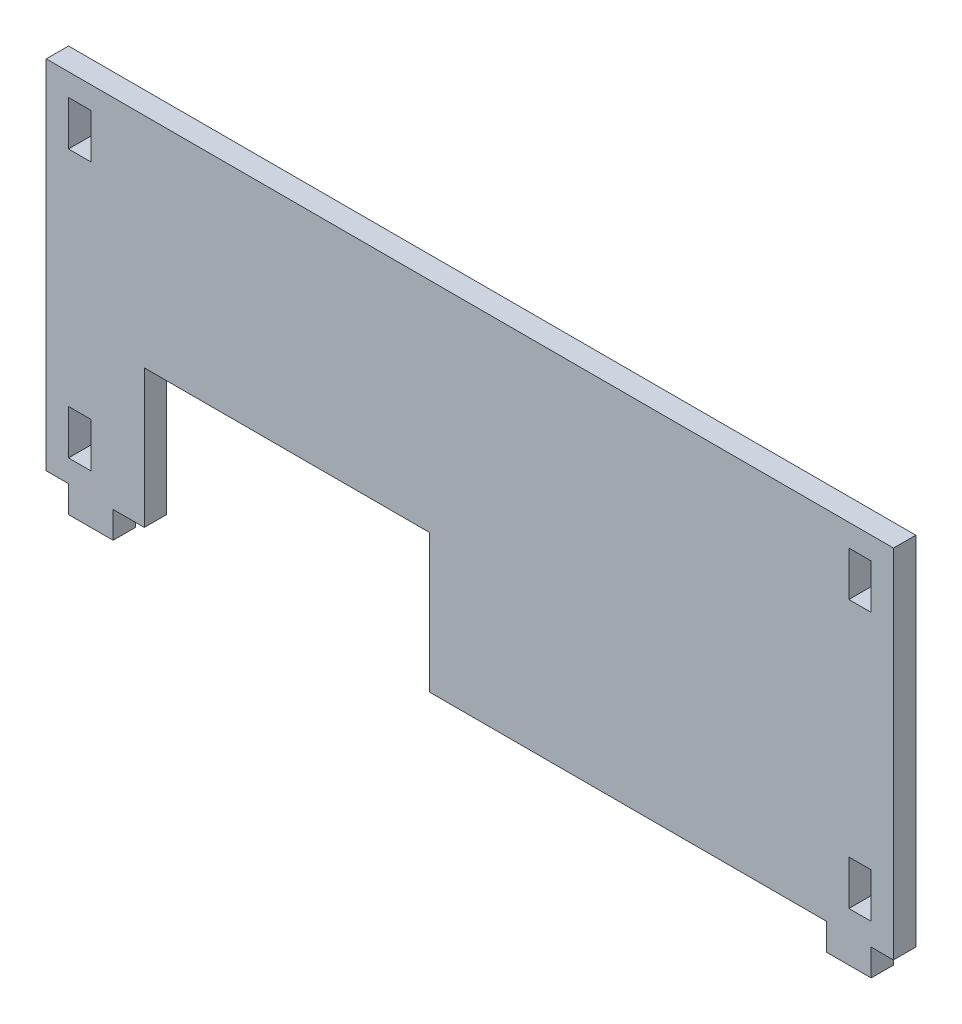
ISO-10303-21;
HEADER;
FILE_DESCRIPTION(('STEP AP214'),'2;1');
FILE_NAME('part.step','',(''),(''),'','','');
FILE_SCHEMA(('AUTOMOTIVE_DESIGN { 1 0 10303 214 1 1 1 1 }'));
ENDSEC;
DATA;
#1=APPLICATION_CONTEXT('core data for automotive mechanical design processes');
#2=APPLICATION_PROTOCOL_DEFINITION('international standard','automotive_design',2000,#1);
#3=PRODUCT_CONTEXT('',#1,'mechanical');
#4=PRODUCT('Part','Part','',(#3));
#5=PRODUCT_RELATED_PRODUCT_CATEGORY('part','',(#4));
#6=PRODUCT_DEFINITION_FORMATION('','',#4);
#7=PRODUCT_DEFINITION_CONTEXT('part definition',#1,'design');
#8=PRODUCT_DEFINITION('design','',#6,#7);
#9=PRODUCT_DEFINITION_SHAPE('','',#8);
#10=(LENGTH_UNIT() NAMED_UNIT(*) SI_UNIT(.MILLI.,.METRE.));
#11=(NAMED_UNIT(*) PLANE_ANGLE_UNIT() SI_UNIT($,.RADIAN.));
#12=(NAMED_UNIT(*) SI_UNIT($,.STERADIAN.) SOLID_ANGLE_UNIT());
#13=UNCERTAINTY_MEASURE_WITH_UNIT(LENGTH_MEASURE(1.E-05),#10,'distance_accuracy_value','');
#14=(GEOMETRIC_REPRESENTATION_CONTEXT(3) GLOBAL_UNCERTAINTY_ASSIGNED_CONTEXT((#13)) GLOBAL_UNIT_ASSIGNED_CONTEXT((#10,
#11,#12)) REPRESENTATION_CONTEXT('',''));
#15=CARTESIAN_POINT('',(0.,0.,0.));
#16=DIRECTION('',(0.,0.,1.));
#17=DIRECTION('',(1.,0.,0.));
#18=AXIS2_PLACEMENT_3D('',#15,#16,#17);
#19=CARTESIAN_POINT('',(0.,0.,3.175));
#20=DIRECTION('',(0.,0.,-1.));
#21=DIRECTION('',(-1.,0.,0.));
#22=AXIS2_PLACEMENT_3D('',#19,#20,#21);
#23=PLANE('',#22);
#24=DIRECTION('',(0.,1.,0.));
#25=VECTOR('',#24,1.);
#26=CARTESIAN_POINT('',(117.475,3.175,3.175));
#27=LINE('',#26,#25);
#28=CARTESIAN_POINT('',(117.475,3.175,3.175));
#29=VERTEX_POINT('',#28);
#30=CARTESIAN_POINT('',(117.475,9.525,3.175));
#31=VERTEX_POINT('',#30);
#32=EDGE_CURVE('E279',#29,#31,#27,.T.);
#33=ORIENTED_EDGE('',*,*,#32,.F.);
#34=DIRECTION('',(1.,0.,0.));
#35=VECTOR('',#34,1.);
#36=CARTESIAN_POINT('',(117.475,3.175,3.175));
#37=LINE('',#36,#35);
#38=CARTESIAN_POINT('',(114.3,3.175,3.175));
#39=VERTEX_POINT('',#38);
#40=EDGE_CURVE('E287',#39,#29,#37,.T.);
#41=ORIENTED_EDGE('',*,*,#40,.F.);
#42=DIRECTION('',(0.,-1.,0.));
#43=VECTOR('',#42,1.);
#44=CARTESIAN_POINT('',(114.3,3.175,3.175));
#45=LINE('',#44,#43);
#46=CARTESIAN_POINT('',(114.3,9.525,3.175));
#47=VERTEX_POINT('',#46);
#48=EDGE_CURVE('E284',#47,#39,#45,.T.);
#49=ORIENTED_EDGE('',*,*,#48,.F.);
#50=DIRECTION('',(-1.,0.,0.));
#51=VECTOR('',#50,1.);
#52=CARTESIAN_POINT('',(117.475,9.525,3.175));
#53=LINE('',#52,#51);
#54=EDGE_CURVE('E281',#31,#47,#53,.T.);
#55=ORIENTED_EDGE('',*,*,#54,.F.);
#56=EDGE_LOOP('',(#33,#41,#49,#55));
#57=FACE_BOUND('',#56,.T.);
#58=DIRECTION('',(0.,-1.,0.));
#59=VECTOR('',#58,1.);
#60=CARTESIAN_POINT('',(3.175,47.625,3.175));
#61=LINE('',#60,#59);
#62=CARTESIAN_POINT('',(3.175,47.625,3.175));
#63=VERTEX_POINT('',#62);
#64=CARTESIAN_POINT('',(3.175,41.275,3.175));
#65=VERTEX_POINT('',#64);
#66=EDGE_CURVE('E341',#63,#65,#61,.T.);
#67=ORIENTED_EDGE('',*,*,#66,.F.);
#68=DIRECTION('',(-1.,0.,0.));
#69=VECTOR('',#68,1.);
#70=CARTESIAN_POINT('',(3.175,47.625,3.175));
#71=LINE('',#70,#69);
#72=CARTESIAN_POINT('',(6.35,47.625,3.175));
#73=VERTEX_POINT('',#72);
#74=EDGE_CURVE('E349',#73,#63,#71,.T.);
#75=ORIENTED_EDGE('',*,*,#74,.F.);
#76=DIRECTION('',(0.,1.,0.));
#77=VECTOR('',#76,1.);
#78=CARTESIAN_POINT('',(6.35,47.625,3.175));
#79=LINE('',#78,#77);
#80=CARTESIAN_POINT('',(6.35,41.275,3.175));
#81=VERTEX_POINT('',#80);
#82=EDGE_CURVE('E346',#81,#73,#79,.T.);
#83=ORIENTED_EDGE('',*,*,#82,.F.);
#84=DIRECTION('',(1.,0.,0.));
#85=VECTOR('',#84,1.);
#86=CARTESIAN_POINT('',(3.175,41.275,3.175));
#87=LINE('',#86,#85);
#88=EDGE_CURVE('E343',#65,#81,#87,.T.);
#89=ORIENTED_EDGE('',*,*,#88,.F.);
#90=EDGE_LOOP('',(#67,#75,#83,#89));
#91=FACE_BOUND('',#90,.T.);
#92=DIRECTION('',(0.,-1.,0.));
#93=VECTOR('',#92,1.);
#94=CARTESIAN_POINT('',(0.,0.,3.175));
#95=LINE('',#94,#93);
#96=CARTESIAN_POINT('',(0.,50.8,3.175));
#97=VERTEX_POINT('',#96);
#98=CARTESIAN_POINT('',(0.,0.,3.175));
#99=VERTEX_POINT('',#98);
#100=EDGE_CURVE('E372',#97,#99,#95,.T.);
#101=ORIENTED_EDGE('',*,*,#100,.T.);
#102=DIRECTION('',(1.,0.,0.));
#103=VECTOR('',#102,1.);
#104=CARTESIAN_POINT('',(0.,0.,3.175));
#105=LINE('',#104,#103);
#106=CARTESIAN_POINT('',(3.175,0.,3.175));
#107=VERTEX_POINT('',#106);
#108=EDGE_CURVE('E375',#99,#107,#105,.T.);
#109=ORIENTED_EDGE('',*,*,#108,.T.);
#110=DIRECTION('',(0.,-1.,0.));
#111=VECTOR('',#110,1.);
#112=CARTESIAN_POINT('',(3.175,0.,3.175));
#113=LINE('',#112,#111);
#114=CARTESIAN_POINT('',(3.175,-3.81,3.175));
#115=VERTEX_POINT('',#114);
#116=EDGE_CURVE('E378',#107,#115,#113,.T.);
#117=ORIENTED_EDGE('',*,*,#116,.T.);
#118=DIRECTION('',(1.,0.,0.));
#119=VECTOR('',#118,1.);
#120=CARTESIAN_POINT('',(3.175,-3.81,3.175));
#121=LINE('',#120,#119);
#122=CARTESIAN_POINT('',(9.525,-3.81,3.175));
#123=VERTEX_POINT('',#122);
#124=EDGE_CURVE('E380',#115,#123,#121,.T.);
#125=ORIENTED_EDGE('',*,*,#124,.T.);
#126=DIRECTION('',(0.,1.,0.));
#127=VECTOR('',#126,1.);
#128=CARTESIAN_POINT('',(9.525,0.,3.175));
#129=LINE('',#128,#127);
#130=CARTESIAN_POINT('',(9.525,0.,3.175));
#131=VERTEX_POINT('',#130);
#132=EDGE_CURVE('E382',#123,#131,#129,.T.);
#133=ORIENTED_EDGE('',*,*,#132,.T.);
#134=DIRECTION('',(1.,0.,0.));
#135=VECTOR('',#134,1.);
#136=CARTESIAN_POINT('',(9.525,0.,3.175));
#137=LINE('',#136,#135);
#138=CARTESIAN_POINT('',(13.97,0.,3.175));
#139=VERTEX_POINT('',#138);
#140=EDGE_CURVE('E384',#131,#139,#137,.T.);
#141=ORIENTED_EDGE('',*,*,#140,.T.);
#142=DIRECTION('',(0.,1.,0.));
#143=VECTOR('',#142,1.);
#144=CARTESIAN_POINT('',(13.97,0.,3.175));
#145=LINE('',#144,#143);
#146=CARTESIAN_POINT('',(13.97,19.685,3.175));
#147=VERTEX_POINT('',#146);
#148=EDGE_CURVE('E386',#139,#147,#145,.T.);
#149=ORIENTED_EDGE('',*,*,#148,.T.);
#150=DIRECTION('',(1.,0.,0.));
#151=VECTOR('',#150,1.);
#152=CARTESIAN_POINT('',(13.97,19.685,3.175));
#153=LINE('',#152,#151);
#154=CARTESIAN_POINT('',(54.61,19.685,3.175));
#155=VERTEX_POINT('',#154);
#156=EDGE_CURVE('E388',#147,#155,#153,.T.);
#157=ORIENTED_EDGE('',*,*,#156,.T.);
#158=DIRECTION('',(0.,-1.,0.));
#159=VECTOR('',#158,1.);
#160=CARTESIAN_POINT('',(54.61,0.,3.175));
#161=LINE('',#160,#159);
#162=CARTESIAN_POINT('',(54.61,0.,3.175));
#163=VERTEX_POINT('',#162);
#164=EDGE_CURVE('E390',#155,#163,#161,.T.);
#165=ORIENTED_EDGE('',*,*,#164,.T.);
#166=DIRECTION('',(1.,0.,0.));
#167=VECTOR('',#166,1.);
#168=CARTESIAN_POINT('',(54.61,0.,3.175));
#169=LINE('',#168,#167);
#170=CARTESIAN_POINT('',(111.125,0.,3.175));
#171=VERTEX_POINT('',#170);
#172=EDGE_CURVE('E392',#163,#171,#169,.T.);
#173=ORIENTED_EDGE('',*,*,#172,.T.);
#174=DIRECTION('',(0.,-1.,0.));
#175=VECTOR('',#174,1.);
#176=CARTESIAN_POINT('',(111.125,0.,3.175));
#177=LINE('',#176,#175);
#178=CARTESIAN_POINT('',(111.125,-3.81,3.175));
#179=VERTEX_POINT('',#178);
#180=EDGE_CURVE('E394',#171,#179,#177,.T.);
#181=ORIENTED_EDGE('',*,*,#180,.T.);
#182=DIRECTION('',(1.,0.,0.));
#183=VECTOR('',#182,1.);
#184=CARTESIAN_POINT('',(117.475,-3.81,3.175));
#185=LINE('',#184,#183);
#186=CARTESIAN_POINT('',(117.475,-3.81,3.175));
#187=VERTEX_POINT('',#186);
#188=EDGE_CURVE('E396',#179,#187,#185,.T.);
#189=ORIENTED_EDGE('',*,*,#188,.T.);
#190=DIRECTION('',(0.,1.,0.));
#191=VECTOR('',#190,1.);
#192=CARTESIAN_POINT('',(117.475,0.,3.175));
#193=LINE('',#192,#191);
#194=CARTESIAN_POINT('',(117.475,0.,3.175));
#195=VERTEX_POINT('',#194);
#196=EDGE_CURVE('E398',#187,#195,#193,.T.);
#197=ORIENTED_EDGE('',*,*,#196,.T.);
#198=DIRECTION('',(1.,0.,0.));
#199=VECTOR('',#198,1.);
#200=CARTESIAN_POINT('',(117.475,0.,3.175));
#201=LINE('',#200,#199);
#202=CARTESIAN_POINT('',(120.65,0.,3.175));
#203=VERTEX_POINT('',#202);
#204=EDGE_CURVE('E400',#195,#203,#201,.T.);
#205=ORIENTED_EDGE('',*,*,#204,.T.);
#206=DIRECTION('',(0.,1.,0.));
#207=VECTOR('',#206,1.);
#208=CARTESIAN_POINT('',(120.65,0.,3.175));
#209=LINE('',#208,#207);
#210=CARTESIAN_POINT('',(120.65,50.8,3.175));
#211=VERTEX_POINT('',#210);
#212=EDGE_CURVE('E402',#203,#211,#209,.T.);
#213=ORIENTED_EDGE('',*,*,#212,.T.);
#214=DIRECTION('',(-1.,0.,0.));
#215=VECTOR('',#214,1.);
#216=CARTESIAN_POINT('',(0.,50.8,3.175));
#217=LINE('',#216,#215);
#218=EDGE_CURVE('E404',#211,#97,#217,.T.);
#219=ORIENTED_EDGE('',*,*,#218,.T.);
#220=EDGE_LOOP('',(#101,#109,#117,#125,#133,#141,#149,#157,#165,#173,#181,#189,#197,#205,#213,#219));
#221=FACE_BOUND('',#220,.T.);
#222=DIRECTION('',(0.,-1.,0.));
#223=VECTOR('',#222,1.);
#224=CARTESIAN_POINT('',(3.175,3.175,3.175));
#225=LINE('',#224,#223);
#226=CARTESIAN_POINT('',(3.175,9.525,3.175));
#227=VERTEX_POINT('',#226);
#228=CARTESIAN_POINT('',(3.175,3.175,3.175));
#229=VERTEX_POINT('',#228);
#230=EDGE_CURVE('E310',#227,#229,#225,.T.);
#231=ORIENTED_EDGE('',*,*,#230,.F.);
#232=DIRECTION('',(-1.,0.,0.));
#233=VECTOR('',#232,1.);
#234=CARTESIAN_POINT('',(3.175,9.525,3.175));
#235=LINE('',#234,#233);
#236=CARTESIAN_POINT('',(6.35,9.525,3.175));
#237=VERTEX_POINT('',#236);
#238=EDGE_CURVE('E318',#237,#227,#235,.T.);
#239=ORIENTED_EDGE('',*,*,#238,.F.);
#240=DIRECTION('',(0.,1.,0.));
#241=VECTOR('',#240,1.);
#242=CARTESIAN_POINT('',(6.35,3.175,3.175));
#243=LINE('',#242,#241);
#244=CARTESIAN_POINT('',(6.35,3.175,3.175));
#245=VERTEX_POINT('',#244);
#246=EDGE_CURVE('E315',#245,#237,#243,.T.);
#247=ORIENTED_EDGE('',*,*,#246,.F.);
#248=DIRECTION('',(1.,0.,0.));
#249=VECTOR('',#248,1.);
#250=CARTESIAN_POINT('',(3.175,3.175,3.175));
#251=LINE('',#250,#249);
#252=EDGE_CURVE('E312',#229,#245,#251,.T.);
#253=ORIENTED_EDGE('',*,*,#252,.F.);
#254=EDGE_LOOP('',(#231,#239,#247,#253));
#255=FACE_BOUND('',#254,.T.);
#256=DIRECTION('',(0.,1.,0.));
#257=VECTOR('',#256,1.);
#258=CARTESIAN_POINT('',(117.475,47.625,3.175));
#259=LINE('',#258,#257);
#260=CARTESIAN_POINT('',(117.475,41.275,3.175));
#261=VERTEX_POINT('',#260);
#262=CARTESIAN_POINT('',(117.475,47.625,3.175));
#263=VERTEX_POINT('',#262);
#264=EDGE_CURVE('E243',#261,#263,#259,.T.);
#265=ORIENTED_EDGE('',*,*,#264,.F.);
#266=DIRECTION('',(1.,0.,0.));
#267=VECTOR('',#266,1.);
#268=CARTESIAN_POINT('',(117.475,41.275,3.175));
#269=LINE('',#268,#267);
#270=CARTESIAN_POINT('',(114.3,41.275,3.175));
#271=VERTEX_POINT('',#270);
#272=EDGE_CURVE('E265',#271,#261,#269,.T.);
#273=ORIENTED_EDGE('',*,*,#272,.F.);
#274=DIRECTION('',(0.,-1.,0.));
#275=VECTOR('',#274,1.);
#276=CARTESIAN_POINT('',(114.3,47.625,3.175));
#277=LINE('',#276,#275);
#278=CARTESIAN_POINT('',(114.3,47.625,3.175));
#279=VERTEX_POINT('',#278);
#280=EDGE_CURVE('E263',#279,#271,#277,.T.);
#281=ORIENTED_EDGE('',*,*,#280,.F.);
#282=DIRECTION('',(-1.,0.,0.));
#283=VECTOR('',#282,1.);
#284=CARTESIAN_POINT('',(117.475,47.625,3.175));
#285=LINE('',#284,#283);
#286=EDGE_CURVE('E251',#263,#279,#285,.T.);
#287=ORIENTED_EDGE('',*,*,#286,.F.);
#288=EDGE_LOOP('',(#265,#273,#281,#287));
#289=FACE_BOUND('',#288,.T.);
#290=ADVANCED_FACE('F34',(#57,#91,#221,#255,#289),#23,.F.);
#291=CARTESIAN_POINT('',(0.,0.,0.));
#292=DIRECTION('',(0.,0.,-1.));
#293=DIRECTION('',(-1.,0.,0.));
#294=AXIS2_PLACEMENT_3D('',#291,#292,#293);
#295=PLANE('',#294);
#296=DIRECTION('',(1.,0.,0.));
#297=VECTOR('',#296,1.);
#298=CARTESIAN_POINT('',(117.475,3.175,0.));
#299=LINE('',#298,#297);
#300=CARTESIAN_POINT('',(114.3,3.175,0.));
#301=VERTEX_POINT('',#300);
#302=CARTESIAN_POINT('',(117.475,3.175,0.));
#303=VERTEX_POINT('',#302);
#304=EDGE_CURVE('E282',#301,#303,#299,.T.);
#305=ORIENTED_EDGE('',*,*,#304,.T.);
#306=DIRECTION('',(0.,1.,0.));
#307=VECTOR('',#306,1.);
#308=CARTESIAN_POINT('',(117.475,3.175,0.));
#309=LINE('',#308,#307);
#310=CARTESIAN_POINT('',(117.475,9.525,0.));
#311=VERTEX_POINT('',#310);
#312=EDGE_CURVE('E259',#303,#311,#309,.T.);
#313=ORIENTED_EDGE('',*,*,#312,.T.);
#314=DIRECTION('',(-1.,0.,0.));
#315=VECTOR('',#314,1.);
#316=CARTESIAN_POINT('',(117.475,9.525,0.));
#317=LINE('',#316,#315);
#318=CARTESIAN_POINT('',(114.3,9.525,0.));
#319=VERTEX_POINT('',#318);
#320=EDGE_CURVE('E292',#311,#319,#317,.T.);
#321=ORIENTED_EDGE('',*,*,#320,.T.);
#322=DIRECTION('',(0.,-1.,0.));
#323=VECTOR('',#322,1.);
#324=CARTESIAN_POINT('',(114.3,3.175,0.));
#325=LINE('',#324,#323);
#326=EDGE_CURVE('E295',#319,#301,#325,.T.);
#327=ORIENTED_EDGE('',*,*,#326,.T.);
#328=EDGE_LOOP('',(#305,#313,#321,#327));
#329=FACE_BOUND('',#328,.T.);
#330=DIRECTION('',(-1.,0.,0.));
#331=VECTOR('',#330,1.);
#332=CARTESIAN_POINT('',(3.175,47.625,0.));
#333=LINE('',#332,#331);
#334=CARTESIAN_POINT('',(6.35,47.625,0.));
#335=VERTEX_POINT('',#334);
#336=CARTESIAN_POINT('',(3.175,47.625,0.));
#337=VERTEX_POINT('',#336);
#338=EDGE_CURVE('E344',#335,#337,#333,.T.);
#339=ORIENTED_EDGE('',*,*,#338,.T.);
#340=DIRECTION('',(0.,-1.,0.));
#341=VECTOR('',#340,1.);
#342=CARTESIAN_POINT('',(3.175,47.625,0.));
#343=LINE('',#342,#341);
#344=CARTESIAN_POINT('',(3.175,41.275,0.));
#345=VERTEX_POINT('',#344);
#346=EDGE_CURVE('E340',#337,#345,#343,.T.);
#347=ORIENTED_EDGE('',*,*,#346,.T.);
#348=DIRECTION('',(1.,0.,0.));
#349=VECTOR('',#348,1.);
#350=CARTESIAN_POINT('',(3.175,41.275,0.));
#351=LINE('',#350,#349);
#352=CARTESIAN_POINT('',(6.35,41.275,0.));
#353=VERTEX_POINT('',#352);
#354=EDGE_CURVE('E354',#345,#353,#351,.T.);
#355=ORIENTED_EDGE('',*,*,#354,.T.);
#356=DIRECTION('',(0.,1.,0.));
#357=VECTOR('',#356,1.);
#358=CARTESIAN_POINT('',(6.35,47.625,0.));
#359=LINE('',#358,#357);
#360=EDGE_CURVE('E357',#353,#335,#359,.T.);
#361=ORIENTED_EDGE('',*,*,#360,.T.);
#362=EDGE_LOOP('',(#339,#347,#355,#361));
#363=FACE_BOUND('',#362,.T.);
#364=DIRECTION('',(0.,-1.,0.));
#365=VECTOR('',#364,1.);
#366=CARTESIAN_POINT('',(0.,0.,0.));
#367=LINE('',#366,#365);
#368=CARTESIAN_POINT('',(0.,50.8,0.));
#369=VERTEX_POINT('',#368);
#370=CARTESIAN_POINT('',(0.,0.,0.));
#371=VERTEX_POINT('',#370);
#372=EDGE_CURVE('E371',#369,#371,#367,.T.);
#373=ORIENTED_EDGE('',*,*,#372,.F.);
#374=DIRECTION('',(-1.,0.,0.));
#375=VECTOR('',#374,1.);
#376=CARTESIAN_POINT('',(0.,50.8,0.));
#377=LINE('',#376,#375);
#378=CARTESIAN_POINT('',(120.65,50.8,0.));
#379=VERTEX_POINT('',#378);
#380=EDGE_CURVE('E376',#379,#369,#377,.T.);
#381=ORIENTED_EDGE('',*,*,#380,.F.);
#382=DIRECTION('',(0.,1.,0.));
#383=VECTOR('',#382,1.);
#384=CARTESIAN_POINT('',(120.65,0.,0.));
#385=LINE('',#384,#383);
#386=CARTESIAN_POINT('',(120.65,0.,0.));
#387=VERTEX_POINT('',#386);
#388=EDGE_CURVE('E435',#387,#379,#385,.T.);
#389=ORIENTED_EDGE('',*,*,#388,.F.);
#390=DIRECTION('',(1.,0.,0.));
#391=VECTOR('',#390,1.);
#392=CARTESIAN_POINT('',(117.475,0.,0.));
#393=LINE('',#392,#391);
#394=CARTESIAN_POINT('',(117.475,0.,0.));
#395=VERTEX_POINT('',#394);
#396=EDGE_CURVE('E433',#395,#387,#393,.T.);
#397=ORIENTED_EDGE('',*,*,#396,.F.);
#398=DIRECTION('',(0.,1.,0.));
#399=VECTOR('',#398,1.);
#400=CARTESIAN_POINT('',(117.475,0.,0.));
#401=LINE('',#400,#399);
#402=CARTESIAN_POINT('',(117.475,-3.81,0.));
#403=VERTEX_POINT('',#402);
#404=EDGE_CURVE('E431',#403,#395,#401,.T.);
#405=ORIENTED_EDGE('',*,*,#404,.F.);
#406=DIRECTION('',(1.,0.,0.));
#407=VECTOR('',#406,1.);
#408=CARTESIAN_POINT('',(117.475,-3.81,0.));
#409=LINE('',#408,#407);
#410=CARTESIAN_POINT('',(111.125,-3.81,0.));
#411=VERTEX_POINT('',#410);
#412=EDGE_CURVE('E429',#411,#403,#409,.T.);
#413=ORIENTED_EDGE('',*,*,#412,.F.);
#414=DIRECTION('',(0.,-1.,0.));
#415=VECTOR('',#414,1.);
#416=CARTESIAN_POINT('',(111.125,0.,0.));
#417=LINE('',#416,#415);
#418=CARTESIAN_POINT('',(111.125,0.,0.));
#419=VERTEX_POINT('',#418);
#420=EDGE_CURVE('E427',#419,#411,#417,.T.);
#421=ORIENTED_EDGE('',*,*,#420,.F.);
#422=DIRECTION('',(1.,0.,0.));
#423=VECTOR('',#422,1.);
#424=CARTESIAN_POINT('',(54.61,0.,0.));
#425=LINE('',#424,#423);
#426=CARTESIAN_POINT('',(54.61,0.,0.));
#427=VERTEX_POINT('',#426);
#428=EDGE_CURVE('E425',#427,#419,#425,.T.);
#429=ORIENTED_EDGE('',*,*,#428,.F.);
#430=DIRECTION('',(0.,-1.,0.));
#431=VECTOR('',#430,1.);
#432=CARTESIAN_POINT('',(54.61,0.,0.));
#433=LINE('',#432,#431);
#434=CARTESIAN_POINT('',(54.61,19.685,0.));
#435=VERTEX_POINT('',#434);
#436=EDGE_CURVE('E423',#435,#427,#433,.T.);
#437=ORIENTED_EDGE('',*,*,#436,.F.);
#438=DIRECTION('',(1.,0.,0.));
#439=VECTOR('',#438,1.);
#440=CARTESIAN_POINT('',(13.97,19.685,0.));
#441=LINE('',#440,#439);
#442=CARTESIAN_POINT('',(13.97,19.685,0.));
#443=VERTEX_POINT('',#442);
#444=EDGE_CURVE('E421',#443,#435,#441,.T.);
#445=ORIENTED_EDGE('',*,*,#444,.F.);
#446=DIRECTION('',(0.,1.,0.));
#447=VECTOR('',#446,1.);
#448=CARTESIAN_POINT('',(13.97,0.,0.));
#449=LINE('',#448,#447);
#450=CARTESIAN_POINT('',(13.97,0.,0.));
#451=VERTEX_POINT('',#450);
#452=EDGE_CURVE('E419',#451,#443,#449,.T.);
#453=ORIENTED_EDGE('',*,*,#452,.F.);
#454=DIRECTION('',(1.,0.,0.));
#455=VECTOR('',#454,1.);
#456=CARTESIAN_POINT('',(9.525,0.,0.));
#457=LINE('',#456,#455);
#458=CARTESIAN_POINT('',(9.525,0.,0.));
#459=VERTEX_POINT('',#458);
#460=EDGE_CURVE('E417',#459,#451,#457,.T.);
#461=ORIENTED_EDGE('',*,*,#460,.F.);
#462=DIRECTION('',(0.,1.,0.));
#463=VECTOR('',#462,1.);
#464=CARTESIAN_POINT('',(9.525,0.,0.));
#465=LINE('',#464,#463);
#466=CARTESIAN_POINT('',(9.525,-3.81,0.));
#467=VERTEX_POINT('',#466);
#468=EDGE_CURVE('E415',#467,#459,#465,.T.);
#469=ORIENTED_EDGE('',*,*,#468,.F.);
#470=DIRECTION('',(1.,0.,0.));
#471=VECTOR('',#470,1.);
#472=CARTESIAN_POINT('',(3.175,-3.81,0.));
#473=LINE('',#472,#471);
#474=CARTESIAN_POINT('',(3.175,-3.81,0.));
#475=VERTEX_POINT('',#474);
#476=EDGE_CURVE('E413',#475,#467,#473,.T.);
#477=ORIENTED_EDGE('',*,*,#476,.F.);
#478=DIRECTION('',(0.,-1.,0.));
#479=VECTOR('',#478,1.);
#480=CARTESIAN_POINT('',(3.175,0.,0.));
#481=LINE('',#480,#479);
#482=CARTESIAN_POINT('',(3.175,0.,0.));
#483=VERTEX_POINT('',#482);
#484=EDGE_CURVE('E411',#483,#475,#481,.T.);
#485=ORIENTED_EDGE('',*,*,#484,.F.);
#486=DIRECTION('',(1.,0.,0.));
#487=VECTOR('',#486,1.);
#488=CARTESIAN_POINT('',(0.,0.,0.));
#489=LINE('',#488,#487);
#490=EDGE_CURVE('E409',#371,#483,#489,.T.);
#491=ORIENTED_EDGE('',*,*,#490,.F.);
#492=EDGE_LOOP('',(#373,#381,#389,#397,#405,#413,#421,#429,#437,#445,#453,#461,#469,#477,#485,#491));
#493=FACE_BOUND('',#492,.T.);
#494=DIRECTION('',(-1.,0.,0.));
#495=VECTOR('',#494,1.);
#496=CARTESIAN_POINT('',(3.175,9.525,0.));
#497=LINE('',#496,#495);
#498=CARTESIAN_POINT('',(6.35,9.525,0.));
#499=VERTEX_POINT('',#498);
#500=CARTESIAN_POINT('',(3.175,9.525,0.));
#501=VERTEX_POINT('',#500);
#502=EDGE_CURVE('E313',#499,#501,#497,.T.);
#503=ORIENTED_EDGE('',*,*,#502,.T.);
#504=DIRECTION('',(0.,-1.,0.));
#505=VECTOR('',#504,1.);
#506=CARTESIAN_POINT('',(3.175,3.175,0.));
#507=LINE('',#506,#505);
#508=CARTESIAN_POINT('',(3.175,3.175,0.));
#509=VERTEX_POINT('',#508);
#510=EDGE_CURVE('E309',#501,#509,#507,.T.);
#511=ORIENTED_EDGE('',*,*,#510,.T.);
#512=DIRECTION('',(1.,0.,0.));
#513=VECTOR('',#512,1.);
#514=CARTESIAN_POINT('',(3.175,3.175,0.));
#515=LINE('',#514,#513);
#516=CARTESIAN_POINT('',(6.35,3.175,0.));
#517=VERTEX_POINT('',#516);
#518=EDGE_CURVE('E323',#509,#517,#515,.T.);
#519=ORIENTED_EDGE('',*,*,#518,.T.);
#520=DIRECTION('',(0.,1.,0.));
#521=VECTOR('',#520,1.);
#522=CARTESIAN_POINT('',(6.35,3.175,0.));
#523=LINE('',#522,#521);
#524=EDGE_CURVE('E326',#517,#499,#523,.T.);
#525=ORIENTED_EDGE('',*,*,#524,.T.);
#526=EDGE_LOOP('',(#503,#511,#519,#525));
#527=FACE_BOUND('',#526,.T.);
#528=DIRECTION('',(1.,0.,0.));
#529=VECTOR('',#528,1.);
#530=CARTESIAN_POINT('',(117.475,41.275,0.));
#531=LINE('',#530,#529);
#532=CARTESIAN_POINT('',(114.3,41.275,0.));
#533=VERTEX_POINT('',#532);
#534=CARTESIAN_POINT('',(117.475,41.275,0.));
#535=VERTEX_POINT('',#534);
#536=EDGE_CURVE('E252',#533,#535,#531,.T.);
#537=ORIENTED_EDGE('',*,*,#536,.T.);
#538=DIRECTION('',(0.,1.,0.));
#539=VECTOR('',#538,1.);
#540=CARTESIAN_POINT('',(117.475,47.625,0.));
#541=LINE('',#540,#539);
#542=CARTESIAN_POINT('',(117.475,47.625,0.));
#543=VERTEX_POINT('',#542);
#544=EDGE_CURVE('E57',#535,#543,#541,.T.);
#545=ORIENTED_EDGE('',*,*,#544,.T.);
#546=DIRECTION('',(-1.,0.,0.));
#547=VECTOR('',#546,1.);
#548=CARTESIAN_POINT('',(117.475,47.625,0.));
#549=LINE('',#548,#547);
#550=CARTESIAN_POINT('',(114.3,47.625,0.));
#551=VERTEX_POINT('',#550);
#552=EDGE_CURVE('E258',#543,#551,#549,.T.);
#553=ORIENTED_EDGE('',*,*,#552,.T.);
#554=DIRECTION('',(0.,-1.,0.));
#555=VECTOR('',#554,1.);
#556=CARTESIAN_POINT('',(114.3,47.625,0.));
#557=LINE('',#556,#555);
#558=EDGE_CURVE('E271',#551,#533,#557,.T.);
#559=ORIENTED_EDGE('',*,*,#558,.T.);
#560=EDGE_LOOP('',(#537,#545,#553,#559));
#561=FACE_BOUND('',#560,.T.);
#562=ADVANCED_FACE('F489',(#329,#363,#493,#527,#561),#295,.T.);
#563=CARTESIAN_POINT('',(0.,0.,3.175));
#564=DIRECTION('',(1.,0.,0.));
#565=DIRECTION('',(0.,0.,-1.));
#566=AXIS2_PLACEMENT_3D('',#563,#564,#565);
#567=PLANE('',#566);
#568=ORIENTED_EDGE('',*,*,#372,.T.);
#569=DIRECTION('',(0.,0.,-1.));
#570=VECTOR('',#569,1.);
#571=CARTESIAN_POINT('',(0.,0.,3.175));
#572=LINE('',#571,#570);
#573=EDGE_CURVE('E11',#99,#371,#572,.T.);
#574=ORIENTED_EDGE('',*,*,#573,.F.);
#575=ORIENTED_EDGE('',*,*,#100,.F.);
#576=DIRECTION('',(0.,0.,-1.));
#577=VECTOR('',#576,1.);
#578=CARTESIAN_POINT('',(0.,50.8,3.175));
#579=LINE('',#578,#577);
#580=EDGE_CURVE('E406',#97,#369,#579,.T.);
#581=ORIENTED_EDGE('',*,*,#580,.T.);
#582=EDGE_LOOP('',(#568,#574,#575,#581));
#583=FACE_BOUND('',#582,.T.);
#584=ADVANCED_FACE('F36',(#583),#567,.F.);
#585=CARTESIAN_POINT('',(0.,0.,3.175));
#586=DIRECTION('',(0.,1.,0.));
#587=DIRECTION('',(0.,0.,1.));
#588=AXIS2_PLACEMENT_3D('',#585,#586,#587);
#589=PLANE('',#588);
#590=ORIENTED_EDGE('',*,*,#490,.T.);
#591=DIRECTION('',(0.,0.,-1.));
#592=VECTOR('',#591,1.);
#593=CARTESIAN_POINT('',(3.175,0.,3.175));
#594=LINE('',#593,#592);
#595=EDGE_CURVE('E42',#107,#483,#594,.T.);
#596=ORIENTED_EDGE('',*,*,#595,.F.);
#597=ORIENTED_EDGE('',*,*,#108,.F.);
#598=ORIENTED_EDGE('',*,*,#573,.T.);
#599=EDGE_LOOP('',(#590,#596,#597,#598));
#600=FACE_BOUND('',#599,.T.);
#601=ADVANCED_FACE('F507',(#600),#589,.F.);
#602=CARTESIAN_POINT('',(3.175,0.,3.175));
#603=DIRECTION('',(1.,0.,0.));
#604=DIRECTION('',(0.,0.,-1.));
#605=AXIS2_PLACEMENT_3D('',#602,#603,#604);
#606=PLANE('',#605);
#607=ORIENTED_EDGE('',*,*,#484,.T.);
#608=DIRECTION('',(0.,0.,-1.));
#609=VECTOR('',#608,1.);
#610=CARTESIAN_POINT('',(3.175,-3.81,3.175));
#611=LINE('',#610,#609);
#612=EDGE_CURVE('E476',#115,#475,#611,.T.);
#613=ORIENTED_EDGE('',*,*,#612,.F.);
#614=ORIENTED_EDGE('',*,*,#116,.F.);
#615=ORIENTED_EDGE('',*,*,#595,.T.);
#616=EDGE_LOOP('',(#607,#613,#614,#615));
#617=FACE_BOUND('',#616,.T.);
#618=ADVANCED_FACE('F483',(#617),#606,.F.);
#619=CARTESIAN_POINT('',(3.175,-3.81,3.175));
#620=DIRECTION('',(0.,1.,0.));
#621=DIRECTION('',(-1.,0.,0.));
#622=AXIS2_PLACEMENT_3D('',#619,#620,#621);
#623=PLANE('',#622);
#624=ORIENTED_EDGE('',*,*,#476,.T.);
#625=DIRECTION('',(0.,0.,-1.));
#626=VECTOR('',#625,1.);
#627=CARTESIAN_POINT('',(9.525,-3.81,3.175));
#628=LINE('',#627,#626);
#629=EDGE_CURVE('E473',#123,#467,#628,.T.);
#630=ORIENTED_EDGE('',*,*,#629,.F.);
#631=ORIENTED_EDGE('',*,*,#124,.F.);
#632=ORIENTED_EDGE('',*,*,#612,.T.);
#633=EDGE_LOOP('',(#624,#630,#631,#632));
#634=FACE_BOUND('',#633,.T.);
#635=ADVANCED_FACE('F495',(#634),#623,.F.);
#636=CARTESIAN_POINT('',(9.525,0.,3.175));
#637=DIRECTION('',(-1.,0.,0.));
#638=DIRECTION('',(0.,0.,1.));
#639=AXIS2_PLACEMENT_3D('',#636,#637,#638);
#640=PLANE('',#639);
#641=ORIENTED_EDGE('',*,*,#468,.T.);
#642=DIRECTION('',(0.,0.,-1.));
#643=VECTOR('',#642,1.);
#644=CARTESIAN_POINT('',(9.525,0.,3.175));
#645=LINE('',#644,#643);
#646=EDGE_CURVE('E470',#131,#459,#645,.T.);
#647=ORIENTED_EDGE('',*,*,#646,.F.);
#648=ORIENTED_EDGE('',*,*,#132,.F.);
#649=ORIENTED_EDGE('',*,*,#629,.T.);
#650=EDGE_LOOP('',(#641,#647,#648,#649));
#651=FACE_BOUND('',#650,.T.);
#652=ADVANCED_FACE('F499',(#651),#640,.F.);
#653=CARTESIAN_POINT('',(9.525,0.,3.175));
#654=DIRECTION('',(0.,1.,0.));
#655=DIRECTION('',(0.,0.,1.));
#656=AXIS2_PLACEMENT_3D('',#653,#654,#655);
#657=PLANE('',#656);
#658=ORIENTED_EDGE('',*,*,#460,.T.);
#659=DIRECTION('',(0.,0.,-1.));
#660=VECTOR('',#659,1.);
#661=CARTESIAN_POINT('',(13.97,0.,3.175));
#662=LINE('',#661,#660);
#663=EDGE_CURVE('E467',#139,#451,#662,.T.);
#664=ORIENTED_EDGE('',*,*,#663,.F.);
#665=ORIENTED_EDGE('',*,*,#140,.F.);
#666=ORIENTED_EDGE('',*,*,#646,.T.);
#667=EDGE_LOOP('',(#658,#664,#665,#666));
#668=FACE_BOUND('',#667,.T.);
#669=ADVANCED_FACE('F560',(#668),#657,.F.);
#670=CARTESIAN_POINT('',(13.97,0.,3.175));
#671=DIRECTION('',(-1.,0.,0.));
#672=DIRECTION('',(0.,0.,1.));
#673=AXIS2_PLACEMENT_3D('',#670,#671,#672);
#674=PLANE('',#673);
#675=ORIENTED_EDGE('',*,*,#452,.T.);
#676=DIRECTION('',(0.,0.,-1.));
#677=VECTOR('',#676,1.);
#678=CARTESIAN_POINT('',(13.97,19.685,3.175));
#679=LINE('',#678,#677);
#680=EDGE_CURVE('E464',#147,#443,#679,.T.);
#681=ORIENTED_EDGE('',*,*,#680,.F.);
#682=ORIENTED_EDGE('',*,*,#148,.F.);
#683=ORIENTED_EDGE('',*,*,#663,.T.);
#684=EDGE_LOOP('',(#675,#681,#682,#683));
#685=FACE_BOUND('',#684,.T.);
#686=ADVANCED_FACE('F557',(#685),#674,.F.);
#687=CARTESIAN_POINT('',(13.97,19.685,3.175));
#688=DIRECTION('',(0.,1.,0.));
#689=DIRECTION('',(0.,0.,1.));
#690=AXIS2_PLACEMENT_3D('',#687,#688,#689);
#691=PLANE('',#690);
#692=ORIENTED_EDGE('',*,*,#444,.T.);
#693=DIRECTION('',(0.,0.,-1.));
#694=VECTOR('',#693,1.);
#695=CARTESIAN_POINT('',(54.61,19.685,3.175));
#696=LINE('',#695,#694);
#697=EDGE_CURVE('E461',#155,#435,#696,.T.);
#698=ORIENTED_EDGE('',*,*,#697,.F.);
#699=ORIENTED_EDGE('',*,*,#156,.F.);
#700=ORIENTED_EDGE('',*,*,#680,.T.);
#701=EDGE_LOOP('',(#692,#698,#699,#700));
#702=FACE_BOUND('',#701,.T.);
#703=ADVANCED_FACE('F553',(#702),#691,.F.);
#704=CARTESIAN_POINT('',(54.61,0.,3.175));
#705=DIRECTION('',(1.,0.,0.));
#706=DIRECTION('',(0.,1.,0.));
#707=AXIS2_PLACEMENT_3D('',#704,#705,#706);
#708=PLANE('',#707);
#709=ORIENTED_EDGE('',*,*,#436,.T.);
#710=DIRECTION('',(0.,0.,-1.));
#711=VECTOR('',#710,1.);
#712=CARTESIAN_POINT('',(54.61,0.,3.175));
#713=LINE('',#712,#711);
#714=EDGE_CURVE('E458',#163,#427,#713,.T.);
#715=ORIENTED_EDGE('',*,*,#714,.F.);
#716=ORIENTED_EDGE('',*,*,#164,.F.);
#717=ORIENTED_EDGE('',*,*,#697,.T.);
#718=EDGE_LOOP('',(#709,#715,#716,#717));
#719=FACE_BOUND('',#718,.T.);
#720=ADVANCED_FACE('F549',(#719),#708,.F.);
#721=CARTESIAN_POINT('',(54.61,0.,3.175));
#722=DIRECTION('',(0.,1.,0.));
#723=DIRECTION('',(0.,0.,1.));
#724=AXIS2_PLACEMENT_3D('',#721,#722,#723);
#725=PLANE('',#724);
#726=ORIENTED_EDGE('',*,*,#428,.T.);
#727=DIRECTION('',(0.,0.,-1.));
#728=VECTOR('',#727,1.);
#729=CARTESIAN_POINT('',(111.125,0.,3.175));
#730=LINE('',#729,#728);
#731=EDGE_CURVE('E455',#171,#419,#730,.T.);
#732=ORIENTED_EDGE('',*,*,#731,.F.);
#733=ORIENTED_EDGE('',*,*,#172,.F.);
#734=ORIENTED_EDGE('',*,*,#714,.T.);
#735=EDGE_LOOP('',(#726,#732,#733,#734));
#736=FACE_BOUND('',#735,.T.);
#737=ADVANCED_FACE('F544',(#736),#725,.F.);
#738=CARTESIAN_POINT('',(111.125,0.,3.175));
#739=DIRECTION('',(1.,0.,0.));
#740=DIRECTION('',(0.,0.,-1.));
#741=AXIS2_PLACEMENT_3D('',#738,#739,#740);
#742=PLANE('',#741);
#743=ORIENTED_EDGE('',*,*,#420,.T.);
#744=DIRECTION('',(0.,0.,-1.));
#745=VECTOR('',#744,1.);
#746=CARTESIAN_POINT('',(111.125,-3.81,3.175));
#747=LINE('',#746,#745);
#748=EDGE_CURVE('E452',#179,#411,#747,.T.);
#749=ORIENTED_EDGE('',*,*,#748,.F.);
#750=ORIENTED_EDGE('',*,*,#180,.F.);
#751=ORIENTED_EDGE('',*,*,#731,.T.);
#752=EDGE_LOOP('',(#743,#749,#750,#751));
#753=FACE_BOUND('',#752,.T.);
#754=ADVANCED_FACE('F538',(#753),#742,.F.);
#755=CARTESIAN_POINT('',(117.475,-3.81,3.175));
#756=DIRECTION('',(0.,1.,0.));
#757=DIRECTION('',(-1.,0.,0.));
#758=AXIS2_PLACEMENT_3D('',#755,#756,#757);
#759=PLANE('',#758);
#760=ORIENTED_EDGE('',*,*,#412,.T.);
#761=DIRECTION('',(0.,0.,-1.));
#762=VECTOR('',#761,1.);
#763=CARTESIAN_POINT('',(117.475,-3.81,3.175));
#764=LINE('',#763,#762);
#765=EDGE_CURVE('E449',#187,#403,#764,.T.);
#766=ORIENTED_EDGE('',*,*,#765,.F.);
#767=ORIENTED_EDGE('',*,*,#188,.F.);
#768=ORIENTED_EDGE('',*,*,#748,.T.);
#769=EDGE_LOOP('',(#760,#766,#767,#768));
#770=FACE_BOUND('',#769,.T.);
#771=ADVANCED_FACE('F534',(#770),#759,.F.);
#772=CARTESIAN_POINT('',(117.475,0.,3.175));
#773=DIRECTION('',(-1.,0.,0.));
#774=DIRECTION('',(0.,-1.,0.));
#775=AXIS2_PLACEMENT_3D('',#772,#773,#774);
#776=PLANE('',#775);
#777=ORIENTED_EDGE('',*,*,#404,.T.);
#778=DIRECTION('',(0.,0.,-1.));
#779=VECTOR('',#778,1.);
#780=CARTESIAN_POINT('',(117.475,0.,3.175));
#781=LINE('',#780,#779);
#782=EDGE_CURVE('E446',#195,#395,#781,.T.);
#783=ORIENTED_EDGE('',*,*,#782,.F.);
#784=ORIENTED_EDGE('',*,*,#196,.F.);
#785=ORIENTED_EDGE('',*,*,#765,.T.);
#786=EDGE_LOOP('',(#777,#783,#784,#785));
#787=FACE_BOUND('',#786,.T.);
#788=ADVANCED_FACE('F529',(#787),#776,.F.);
#789=CARTESIAN_POINT('',(117.475,0.,3.175));
#790=DIRECTION('',(0.,1.,0.));
#791=DIRECTION('',(0.,0.,1.));
#792=AXIS2_PLACEMENT_3D('',#789,#790,#791);
#793=PLANE('',#792);
#794=ORIENTED_EDGE('',*,*,#396,.T.);
#795=DIRECTION('',(0.,0.,-1.));
#796=VECTOR('',#795,1.);
#797=CARTESIAN_POINT('',(120.65,0.,3.175));
#798=LINE('',#797,#796);
#799=EDGE_CURVE('E443',#203,#387,#798,.T.);
#800=ORIENTED_EDGE('',*,*,#799,.F.);
#801=ORIENTED_EDGE('',*,*,#204,.F.);
#802=ORIENTED_EDGE('',*,*,#782,.T.);
#803=EDGE_LOOP('',(#794,#800,#801,#802));
#804=FACE_BOUND('',#803,.T.);
#805=ADVANCED_FACE('F523',(#804),#793,.F.);
#806=CARTESIAN_POINT('',(120.65,0.,3.175));
#807=DIRECTION('',(-1.,0.,0.));
#808=DIRECTION('',(0.,0.,1.));
#809=AXIS2_PLACEMENT_3D('',#806,#807,#808);
#810=PLANE('',#809);
#811=ORIENTED_EDGE('',*,*,#388,.T.);
#812=DIRECTION('',(0.,0.,-1.));
#813=VECTOR('',#812,1.);
#814=CARTESIAN_POINT('',(120.65,50.8,3.175));
#815=LINE('',#814,#813);
#816=EDGE_CURVE('E440',#211,#379,#815,.T.);
#817=ORIENTED_EDGE('',*,*,#816,.F.);
#818=ORIENTED_EDGE('',*,*,#212,.F.);
#819=ORIENTED_EDGE('',*,*,#799,.T.);
#820=EDGE_LOOP('',(#811,#817,#818,#819));
#821=FACE_BOUND('',#820,.T.);
#822=ADVANCED_FACE('F519',(#821),#810,.F.);
#823=CARTESIAN_POINT('',(0.,50.8,3.175));
#824=DIRECTION('',(0.,-1.,0.));
#825=DIRECTION('',(0.,0.,-1.));
#826=AXIS2_PLACEMENT_3D('',#823,#824,#825);
#827=PLANE('',#826);
#828=ORIENTED_EDGE('',*,*,#380,.T.);
#829=ORIENTED_EDGE('',*,*,#580,.F.);
#830=ORIENTED_EDGE('',*,*,#218,.F.);
#831=ORIENTED_EDGE('',*,*,#816,.T.);
#832=EDGE_LOOP('',(#828,#829,#830,#831));
#833=FACE_BOUND('',#832,.T.);
#834=ADVANCED_FACE('F514',(#833),#827,.F.);
#835=CARTESIAN_POINT('',(3.175,47.625,3.175));
#836=DIRECTION('',(1.,0.,0.));
#837=DIRECTION('',(0.,1.,0.));
#838=AXIS2_PLACEMENT_3D('',#835,#836,#837);
#839=PLANE('',#838);
#840=ORIENTED_EDGE('',*,*,#346,.F.);
#841=DIRECTION('',(0.,0.,-1.));
#842=VECTOR('',#841,1.);
#843=CARTESIAN_POINT('',(3.175,47.625,3.175));
#844=LINE('',#843,#842);
#845=EDGE_CURVE('E351',#63,#337,#844,.T.);
#846=ORIENTED_EDGE('',*,*,#845,.F.);
#847=ORIENTED_EDGE('',*,*,#66,.T.);
#848=DIRECTION('',(0.,0.,-1.));
#849=VECTOR('',#848,1.);
#850=CARTESIAN_POINT('',(3.175,41.275,3.175));
#851=LINE('',#850,#849);
#852=EDGE_CURVE('E368',#65,#345,#851,.T.);
#853=ORIENTED_EDGE('',*,*,#852,.T.);
#854=EDGE_LOOP('',(#840,#846,#847,#853));
#855=FACE_BOUND('',#854,.T.);
#856=ADVANCED_FACE('F581',(#855),#839,.T.);
#857=CARTESIAN_POINT('',(3.175,41.275,3.175));
#858=DIRECTION('',(0.,1.,0.));
#859=DIRECTION('',(0.,0.,1.));
#860=AXIS2_PLACEMENT_3D('',#857,#858,#859);
#861=PLANE('',#860);
#862=ORIENTED_EDGE('',*,*,#354,.F.);
#863=ORIENTED_EDGE('',*,*,#852,.F.);
#864=ORIENTED_EDGE('',*,*,#88,.T.);
#865=DIRECTION('',(0.,0.,-1.));
#866=VECTOR('',#865,1.);
#867=CARTESIAN_POINT('',(6.35,41.275,3.175));
#868=LINE('',#867,#866);
#869=EDGE_CURVE('E366',#81,#353,#868,.T.);
#870=ORIENTED_EDGE('',*,*,#869,.T.);
#871=EDGE_LOOP('',(#862,#863,#864,#870));
#872=FACE_BOUND('',#871,.T.);
#873=ADVANCED_FACE('F643',(#872),#861,.T.);
#874=CARTESIAN_POINT('',(6.35,47.625,3.175));
#875=DIRECTION('',(-1.,0.,0.));
#876=DIRECTION('',(0.,-1.,0.));
#877=AXIS2_PLACEMENT_3D('',#874,#875,#876);
#878=PLANE('',#877);
#879=ORIENTED_EDGE('',*,*,#360,.F.);
#880=ORIENTED_EDGE('',*,*,#869,.F.);
#881=ORIENTED_EDGE('',*,*,#82,.T.);
#882=DIRECTION('',(0.,0.,-1.));
#883=VECTOR('',#882,1.);
#884=CARTESIAN_POINT('',(6.35,47.625,3.175));
#885=LINE('',#884,#883);
#886=EDGE_CURVE('E364',#73,#335,#885,.T.);
#887=ORIENTED_EDGE('',*,*,#886,.T.);
#888=EDGE_LOOP('',(#879,#880,#881,#887));
#889=FACE_BOUND('',#888,.T.);
#890=ADVANCED_FACE('F650',(#889),#878,.T.);
#891=CARTESIAN_POINT('',(3.175,47.625,3.175));
#892=DIRECTION('',(0.,-1.,0.));
#893=DIRECTION('',(0.,0.,-1.));
#894=AXIS2_PLACEMENT_3D('',#891,#892,#893);
#895=PLANE('',#894);
#896=ORIENTED_EDGE('',*,*,#338,.F.);
#897=ORIENTED_EDGE('',*,*,#886,.F.);
#898=ORIENTED_EDGE('',*,*,#74,.T.);
#899=ORIENTED_EDGE('',*,*,#845,.T.);
#900=EDGE_LOOP('',(#896,#897,#898,#899));
#901=FACE_BOUND('',#900,.T.);
#902=ADVANCED_FACE('F657',(#901),#895,.T.);
#903=CARTESIAN_POINT('',(3.175,3.175,3.175));
#904=DIRECTION('',(1.,0.,0.));
#905=DIRECTION('',(0.,1.,0.));
#906=AXIS2_PLACEMENT_3D('',#903,#904,#905);
#907=PLANE('',#906);
#908=ORIENTED_EDGE('',*,*,#510,.F.);
#909=DIRECTION('',(0.,0.,-1.));
#910=VECTOR('',#909,1.);
#911=CARTESIAN_POINT('',(3.175,9.525,3.175));
#912=LINE('',#911,#910);
#913=EDGE_CURVE('E320',#227,#501,#912,.T.);
#914=ORIENTED_EDGE('',*,*,#913,.F.);
#915=ORIENTED_EDGE('',*,*,#230,.T.);
#916=DIRECTION('',(0.,0.,-1.));
#917=VECTOR('',#916,1.);
#918=CARTESIAN_POINT('',(3.175,3.175,3.175));
#919=LINE('',#918,#917);
#920=EDGE_CURVE('E337',#229,#509,#919,.T.);
#921=ORIENTED_EDGE('',*,*,#920,.T.);
#922=EDGE_LOOP('',(#908,#914,#915,#921));
#923=FACE_BOUND('',#922,.T.);
#924=ADVANCED_FACE('F665',(#923),#907,.T.);
#925=CARTESIAN_POINT('',(3.175,3.175,3.175));
#926=DIRECTION('',(0.,1.,0.));
#927=DIRECTION('',(0.,0.,1.));
#928=AXIS2_PLACEMENT_3D('',#925,#926,#927);
#929=PLANE('',#928);
#930=ORIENTED_EDGE('',*,*,#518,.F.);
#931=ORIENTED_EDGE('',*,*,#920,.F.);
#932=ORIENTED_EDGE('',*,*,#252,.T.);
#933=DIRECTION('',(0.,0.,-1.));
#934=VECTOR('',#933,1.);
#935=CARTESIAN_POINT('',(6.35,3.175,3.175));
#936=LINE('',#935,#934);
#937=EDGE_CURVE('E335',#245,#517,#936,.T.);
#938=ORIENTED_EDGE('',*,*,#937,.T.);
#939=EDGE_LOOP('',(#930,#931,#932,#938));
#940=FACE_BOUND('',#939,.T.);
#941=ADVANCED_FACE('F673',(#940),#929,.T.);
#942=CARTESIAN_POINT('',(6.35,3.175,3.175));
#943=DIRECTION('',(-1.,0.,0.));
#944=DIRECTION('',(0.,-1.,0.));
#945=AXIS2_PLACEMENT_3D('',#942,#943,#944);
#946=PLANE('',#945);
#947=ORIENTED_EDGE('',*,*,#524,.F.);
#948=ORIENTED_EDGE('',*,*,#937,.F.);
#949=ORIENTED_EDGE('',*,*,#246,.T.);
#950=DIRECTION('',(0.,0.,-1.));
#951=VECTOR('',#950,1.);
#952=CARTESIAN_POINT('',(6.35,9.525,3.175));
#953=LINE('',#952,#951);
#954=EDGE_CURVE('E333',#237,#499,#953,.T.);
#955=ORIENTED_EDGE('',*,*,#954,.T.);
#956=EDGE_LOOP('',(#947,#948,#949,#955));
#957=FACE_BOUND('',#956,.T.);
#958=ADVANCED_FACE('F681',(#957),#946,.T.);
#959=CARTESIAN_POINT('',(3.175,9.525,3.175));
#960=DIRECTION('',(0.,-1.,0.));
#961=DIRECTION('',(0.,0.,-1.));
#962=AXIS2_PLACEMENT_3D('',#959,#960,#961);
#963=PLANE('',#962);
#964=ORIENTED_EDGE('',*,*,#502,.F.);
#965=ORIENTED_EDGE('',*,*,#954,.F.);
#966=ORIENTED_EDGE('',*,*,#238,.T.);
#967=ORIENTED_EDGE('',*,*,#913,.T.);
#968=EDGE_LOOP('',(#964,#965,#966,#967));
#969=FACE_BOUND('',#968,.T.);
#970=ADVANCED_FACE('F689',(#969),#963,.T.);
#971=CARTESIAN_POINT('',(117.475,3.175,3.175));
#972=DIRECTION('',(-1.,0.,0.));
#973=DIRECTION('',(0.,0.,1.));
#974=AXIS2_PLACEMENT_3D('',#971,#972,#973);
#975=PLANE('',#974);
#976=ORIENTED_EDGE('',*,*,#312,.F.);
#977=DIRECTION('',(0.,0.,-1.));
#978=VECTOR('',#977,1.);
#979=CARTESIAN_POINT('',(117.475,3.175,3.175));
#980=LINE('',#979,#978);
#981=EDGE_CURVE('E289',#29,#303,#980,.T.);
#982=ORIENTED_EDGE('',*,*,#981,.F.);
#983=ORIENTED_EDGE('',*,*,#32,.T.);
#984=DIRECTION('',(0.,0.,-1.));
#985=VECTOR('',#984,1.);
#986=CARTESIAN_POINT('',(117.475,9.525,3.175));
#987=LINE('',#986,#985);
#988=EDGE_CURVE('E306',#31,#311,#987,.T.);
#989=ORIENTED_EDGE('',*,*,#988,.T.);
#990=EDGE_LOOP('',(#976,#982,#983,#989));
#991=FACE_BOUND('',#990,.T.);
#992=ADVANCED_FACE('F697',(#991),#975,.T.);
#993=CARTESIAN_POINT('',(117.475,9.525,3.175));
#994=DIRECTION('',(0.,-1.,0.));
#995=DIRECTION('',(0.,0.,-1.));
#996=AXIS2_PLACEMENT_3D('',#993,#994,#995);
#997=PLANE('',#996);
#998=ORIENTED_EDGE('',*,*,#320,.F.);
#999=ORIENTED_EDGE('',*,*,#988,.F.);
#1000=ORIENTED_EDGE('',*,*,#54,.T.);
#1001=DIRECTION('',(0.,0.,-1.));
#1002=VECTOR('',#1001,1.);
#1003=CARTESIAN_POINT('',(114.3,9.525,3.175));
#1004=LINE('',#1003,#1002);
#1005=EDGE_CURVE('E304',#47,#319,#1004,.T.);
#1006=ORIENTED_EDGE('',*,*,#1005,.T.);
#1007=EDGE_LOOP('',(#998,#999,#1000,#1006));
#1008=FACE_BOUND('',#1007,.T.);
#1009=ADVANCED_FACE('F705',(#1008),#997,.T.);
#1010=CARTESIAN_POINT('',(114.3,3.175,3.175));
#1011=DIRECTION('',(1.,0.,0.));
#1012=DIRECTION('',(0.,0.,-1.));
#1013=AXIS2_PLACEMENT_3D('',#1010,#1011,#1012);
#1014=PLANE('',#1013);
#1015=ORIENTED_EDGE('',*,*,#326,.F.);
#1016=ORIENTED_EDGE('',*,*,#1005,.F.);
#1017=ORIENTED_EDGE('',*,*,#48,.T.);
#1018=DIRECTION('',(0.,0.,-1.));
#1019=VECTOR('',#1018,1.);
#1020=CARTESIAN_POINT('',(114.3,3.175,3.175));
#1021=LINE('',#1020,#1019);
#1022=EDGE_CURVE('E302',#39,#301,#1021,.T.);
#1023=ORIENTED_EDGE('',*,*,#1022,.T.);
#1024=EDGE_LOOP('',(#1015,#1016,#1017,#1023));
#1025=FACE_BOUND('',#1024,.T.);
#1026=ADVANCED_FACE('F713',(#1025),#1014,.T.);
#1027=CARTESIAN_POINT('',(117.475,3.175,3.175));
#1028=DIRECTION('',(0.,1.,0.));
#1029=DIRECTION('',(0.,0.,1.));
#1030=AXIS2_PLACEMENT_3D('',#1027,#1028,#1029);
#1031=PLANE('',#1030);
#1032=ORIENTED_EDGE('',*,*,#304,.F.);
#1033=ORIENTED_EDGE('',*,*,#1022,.F.);
#1034=ORIENTED_EDGE('',*,*,#40,.T.);
#1035=ORIENTED_EDGE('',*,*,#981,.T.);
#1036=EDGE_LOOP('',(#1032,#1033,#1034,#1035));
#1037=FACE_BOUND('',#1036,.T.);
#1038=ADVANCED_FACE('F721',(#1037),#1031,.T.);
#1039=CARTESIAN_POINT('',(117.475,47.625,3.175));
#1040=DIRECTION('',(-1.,0.,0.));
#1041=DIRECTION('',(0.,0.,1.));
#1042=AXIS2_PLACEMENT_3D('',#1039,#1040,#1041);
#1043=PLANE('',#1042);
#1044=ORIENTED_EDGE('',*,*,#544,.F.);
#1045=DIRECTION('',(0.,0.,-1.));
#1046=VECTOR('',#1045,1.);
#1047=CARTESIAN_POINT('',(117.475,41.275,3.175));
#1048=LINE('',#1047,#1046);
#1049=EDGE_CURVE('E247',#261,#535,#1048,.T.);
#1050=ORIENTED_EDGE('',*,*,#1049,.F.);
#1051=ORIENTED_EDGE('',*,*,#264,.T.);
#1052=DIRECTION('',(0.,0.,-1.));
#1053=VECTOR('',#1052,1.);
#1054=CARTESIAN_POINT('',(117.475,47.625,3.175));
#1055=LINE('',#1054,#1053);
#1056=EDGE_CURVE('E246',#263,#543,#1055,.T.);
#1057=ORIENTED_EDGE('',*,*,#1056,.T.);
#1058=EDGE_LOOP('',(#1044,#1050,#1051,#1057));
#1059=FACE_BOUND('',#1058,.T.);
#1060=ADVANCED_FACE('F245',(#1059),#1043,.T.);
#1061=CARTESIAN_POINT('',(117.475,47.625,3.175));
#1062=DIRECTION('',(0.,-1.,0.));
#1063=DIRECTION('',(0.,0.,-1.));
#1064=AXIS2_PLACEMENT_3D('',#1061,#1062,#1063);
#1065=PLANE('',#1064);
#1066=ORIENTED_EDGE('',*,*,#552,.F.);
#1067=ORIENTED_EDGE('',*,*,#1056,.F.);
#1068=ORIENTED_EDGE('',*,*,#286,.T.);
#1069=DIRECTION('',(0.,0.,-1.));
#1070=VECTOR('',#1069,1.);
#1071=CARTESIAN_POINT('',(114.3,47.625,3.175));
#1072=LINE('',#1071,#1070);
#1073=EDGE_CURVE('E260',#279,#551,#1072,.T.);
#1074=ORIENTED_EDGE('',*,*,#1073,.T.);
#1075=EDGE_LOOP('',(#1066,#1067,#1068,#1074));
#1076=FACE_BOUND('',#1075,.T.);
#1077=ADVANCED_FACE('F255',(#1076),#1065,.T.);
#1078=CARTESIAN_POINT('',(114.3,47.625,3.175));
#1079=DIRECTION('',(1.,0.,0.));
#1080=DIRECTION('',(0.,0.,-1.));
#1081=AXIS2_PLACEMENT_3D('',#1078,#1079,#1080);
#1082=PLANE('',#1081);
#1083=ORIENTED_EDGE('',*,*,#558,.F.);
#1084=ORIENTED_EDGE('',*,*,#1073,.F.);
#1085=ORIENTED_EDGE('',*,*,#280,.T.);
#1086=DIRECTION('',(0.,0.,-1.));
#1087=VECTOR('',#1086,1.);
#1088=CARTESIAN_POINT('',(114.3,41.275,3.175));
#1089=LINE('',#1088,#1087);
#1090=EDGE_CURVE('E49',#271,#533,#1089,.T.);
#1091=ORIENTED_EDGE('',*,*,#1090,.T.);
#1092=EDGE_LOOP('',(#1083,#1084,#1085,#1091));
#1093=FACE_BOUND('',#1092,.T.);
#1094=ADVANCED_FACE('F742',(#1093),#1082,.T.);
#1095=CARTESIAN_POINT('',(117.475,41.275,3.175));
#1096=DIRECTION('',(0.,1.,0.));
#1097=DIRECTION('',(0.,0.,1.));
#1098=AXIS2_PLACEMENT_3D('',#1095,#1096,#1097);
#1099=PLANE('',#1098);
#1100=ORIENTED_EDGE('',*,*,#536,.F.);
#1101=ORIENTED_EDGE('',*,*,#1090,.F.);
#1102=ORIENTED_EDGE('',*,*,#272,.T.);
#1103=ORIENTED_EDGE('',*,*,#1049,.T.);
#1104=EDGE_LOOP('',(#1100,#1101,#1102,#1103));
#1105=FACE_BOUND('',#1104,.T.);
#1106=ADVANCED_FACE('F749',(#1105),#1099,.T.);
#1107=CLOSED_SHELL('',(#290,#562,#584,#601,#618,#635,#652,#669,#686,#703,#720,#737,#754,#771,
#788,#805,#822,#834,#856,#873,#890,#902,#924,#941,#958,#970,#992,#1009,#1026,#1038,#1060,#1077,
#1094,#1106));
#1108=MANIFOLD_SOLID_BREP('B2',#1107);
#1109=ADVANCED_BREP_SHAPE_REPRESENTATION('',(#18,#1108),#14);
#1110=SHAPE_DEFINITION_REPRESENTATION(#9,#1109);
ENDSEC;
END-ISO-10303-21;
